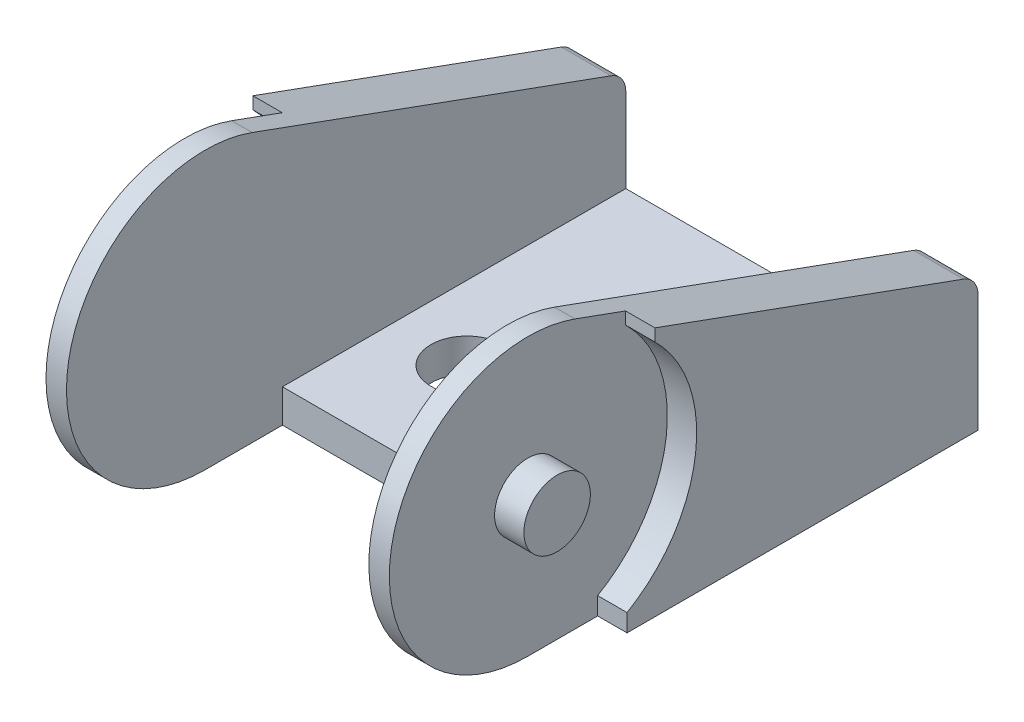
ISO-10303-21;
HEADER;
FILE_DESCRIPTION(('STEP AP214'),'2;1');
FILE_NAME('part.step','',(''),(''),'','','');
FILE_SCHEMA(('AUTOMOTIVE_DESIGN { 1 0 10303 214 1 1 1 1 }'));
ENDSEC;
DATA;
#1=APPLICATION_CONTEXT('core data for automotive mechanical design processes');
#2=APPLICATION_PROTOCOL_DEFINITION('international standard','automotive_design',2000,#1);
#3=PRODUCT_CONTEXT('',#1,'mechanical');
#4=PRODUCT('Part','Part','',(#3));
#5=PRODUCT_RELATED_PRODUCT_CATEGORY('part','',(#4));
#6=PRODUCT_DEFINITION_FORMATION('','',#4);
#7=PRODUCT_DEFINITION_CONTEXT('part definition',#1,'design');
#8=PRODUCT_DEFINITION('design','',#6,#7);
#9=PRODUCT_DEFINITION_SHAPE('','',#8);
#10=(LENGTH_UNIT() NAMED_UNIT(*) SI_UNIT(.MILLI.,.METRE.));
#11=(NAMED_UNIT(*) PLANE_ANGLE_UNIT() SI_UNIT($,.RADIAN.));
#12=(NAMED_UNIT(*) SI_UNIT($,.STERADIAN.) SOLID_ANGLE_UNIT());
#13=UNCERTAINTY_MEASURE_WITH_UNIT(LENGTH_MEASURE(1.E-05),#10,'distance_accuracy_value','');
#14=(GEOMETRIC_REPRESENTATION_CONTEXT(3) GLOBAL_UNCERTAINTY_ASSIGNED_CONTEXT((#13)) GLOBAL_UNIT_ASSIGNED_CONTEXT((#10,
#11,#12)) REPRESENTATION_CONTEXT('',''));
#15=CARTESIAN_POINT('',(0.,0.,0.));
#16=DIRECTION('',(0.,0.,1.));
#17=DIRECTION('',(1.,0.,0.));
#18=AXIS2_PLACEMENT_3D('',#15,#16,#17);
#19=CARTESIAN_POINT('',(-18.15,3.,-38.));
#20=DIRECTION('',(1.,0.,0.));
#21=DIRECTION('',(0.,0.,-1.));
#22=AXIS2_PLACEMENT_3D('',#19,#20,#21);
#23=PLANE('',#22);
#24=CARTESIAN_POINT('',(-18.15,12.5,0.));
#25=DIRECTION('',(1.,0.,0.));
#26=DIRECTION('',(0.,0.,-1.));
#27=AXIS2_PLACEMENT_3D('',#24,#25,#26);
#28=CIRCLE('',#27,3.);
#29=CARTESIAN_POINT('',(-18.15,12.5,-3.));
#30=VERTEX_POINT('',#29);
#31=EDGE_CURVE('E19',#30,#30,#28,.T.);
#32=ORIENTED_EDGE('',*,*,#31,.F.);
#33=EDGE_LOOP('',(#32));
#34=FACE_BOUND('',#33,.T.);
#35=ADVANCED_FACE('F16',(#34),#23,.F.);
#36=CARTESIAN_POINT('',(18.15,3.,-7.));
#37=DIRECTION('',(-1.,0.,0.));
#38=DIRECTION('',(0.,0.,1.));
#39=AXIS2_PLACEMENT_3D('',#36,#37,#38);
#40=PLANE('',#39);
#41=CARTESIAN_POINT('',(18.15,12.5,0.));
#42=DIRECTION('',(-1.,0.,0.));
#43=DIRECTION('',(0.,0.,1.));
#44=AXIS2_PLACEMENT_3D('',#41,#42,#43);
#45=CIRCLE('',#44,3.);
#46=CARTESIAN_POINT('',(18.15,12.5,3.));
#47=VERTEX_POINT('',#46);
#48=EDGE_CURVE('E322',#47,#47,#45,.T.);
#49=ORIENTED_EDGE('',*,*,#48,.F.);
#50=EDGE_LOOP('',(#49));
#51=FACE_BOUND('',#50,.T.);
#52=ADVANCED_FACE('F337',(#51),#40,.F.);
#53=CARTESIAN_POINT('',(15.5,21.4874044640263,-8.831));
#54=DIRECTION('',(0.,0.,-1.));
#55=DIRECTION('',(-1.,0.,0.));
#56=AXIS2_PLACEMENT_3D('',#53,#54,#55);
#57=PLANE('',#56);
#58=DIRECTION('',(1.,0.,0.));
#59=VECTOR('',#58,1.);
#60=CARTESIAN_POINT('',(13.65,22.591874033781,-8.831));
#61=LINE('',#60,#59);
#62=CARTESIAN_POINT('',(15.5,22.591874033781,-8.831));
#63=VERTEX_POINT('',#62);
#64=CARTESIAN_POINT('',(18.15,22.591874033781,-8.831));
#65=VERTEX_POINT('',#64);
#66=EDGE_CURVE('E324',#63,#65,#61,.T.);
#67=ORIENTED_EDGE('',*,*,#66,.F.);
#68=DIRECTION('',(0.,1.,0.));
#69=VECTOR('',#68,1.);
#70=CARTESIAN_POINT('',(15.5,21.4874044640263,-8.831));
#71=LINE('',#70,#69);
#72=CARTESIAN_POINT('',(15.5,21.4874044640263,-8.831));
#73=VERTEX_POINT('',#72);
#74=EDGE_CURVE('E241',#73,#63,#71,.T.);
#75=ORIENTED_EDGE('',*,*,#74,.F.);
#76=DIRECTION('',(-1.,0.,0.));
#77=VECTOR('',#76,1.);
#78=CARTESIAN_POINT('',(15.5,21.4874044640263,-8.831));
#79=LINE('',#78,#77);
#80=CARTESIAN_POINT('',(18.15,21.4874044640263,-8.831));
#81=VERTEX_POINT('',#80);
#82=EDGE_CURVE('E328',#73,#81,#79,.F.);
#83=ORIENTED_EDGE('',*,*,#82,.T.);
#84=DIRECTION('',(0.,1.,0.));
#85=VECTOR('',#84,1.);
#86=CARTESIAN_POINT('',(18.15,21.4874044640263,-8.831));
#87=LINE('',#86,#85);
#88=EDGE_CURVE('E235',#65,#81,#87,.F.);
#89=ORIENTED_EDGE('',*,*,#88,.F.);
#90=EDGE_LOOP('',(#67,#75,#83,#89));
#91=FACE_BOUND('',#90,.T.);
#92=ADVANCED_FACE('F343',(#91),#57,.F.);
#93=CARTESIAN_POINT('',(-15.5,21.4874044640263,-8.831));
#94=DIRECTION('',(0.,0.,1.));
#95=DIRECTION('',(1.,0.,0.));
#96=AXIS2_PLACEMENT_3D('',#93,#94,#95);
#97=PLANE('',#96);
#98=DIRECTION('',(0.,1.,0.));
#99=VECTOR('',#98,1.);
#100=CARTESIAN_POINT('',(-15.5,21.4874044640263,-8.831));
#101=LINE('',#100,#99);
#102=CARTESIAN_POINT('',(-15.5,21.4874044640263,-8.831));
#103=VERTEX_POINT('',#102);
#104=CARTESIAN_POINT('',(-15.5,22.591874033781,-8.831));
#105=VERTEX_POINT('',#104);
#106=EDGE_CURVE('E234',#103,#105,#101,.T.);
#107=ORIENTED_EDGE('',*,*,#106,.T.);
#108=DIRECTION('',(1.,0.,0.));
#109=VECTOR('',#108,1.);
#110=CARTESIAN_POINT('',(-13.65,22.591874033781,-8.831));
#111=LINE('',#110,#109);
#112=CARTESIAN_POINT('',(-18.15,22.591874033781,-8.831));
#113=VERTEX_POINT('',#112);
#114=EDGE_CURVE('E573',#105,#113,#111,.F.);
#115=ORIENTED_EDGE('',*,*,#114,.T.);
#116=DIRECTION('',(0.,1.,0.));
#117=VECTOR('',#116,1.);
#118=CARTESIAN_POINT('',(-18.15,21.4874044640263,-8.831));
#119=LINE('',#118,#117);
#120=CARTESIAN_POINT('',(-18.15,21.4874044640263,-8.831));
#121=VERTEX_POINT('',#120);
#122=EDGE_CURVE('E232',#113,#121,#119,.F.);
#123=ORIENTED_EDGE('',*,*,#122,.T.);
#124=DIRECTION('',(1.,0.,0.));
#125=VECTOR('',#124,1.);
#126=CARTESIAN_POINT('',(-15.5,21.4874044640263,-8.831));
#127=LINE('',#126,#125);
#128=EDGE_CURVE('E208',#121,#103,#127,.T.);
#129=ORIENTED_EDGE('',*,*,#128,.T.);
#130=EDGE_LOOP('',(#107,#115,#123,#129));
#131=FACE_BOUND('',#130,.T.);
#132=ADVANCED_FACE('F461',(#131),#97,.T.);
#133=CARTESIAN_POINT('',(-15.5,12.5,0.));
#134=DIRECTION('',(1.,0.,0.));
#135=DIRECTION('',(0.,0.,-1.));
#136=AXIS2_PLACEMENT_3D('',#133,#134,#135);
#137=CYLINDRICAL_SURFACE('',#136,3.);
#138=ORIENTED_EDGE('',*,*,#31,.T.);
#139=EDGE_LOOP('',(#138));
#140=FACE_BOUND('',#139,.T.);
#141=CARTESIAN_POINT('',(-15.5,12.5,0.));
#142=DIRECTION('',(1.,0.,0.));
#143=DIRECTION('',(0.,0.,-1.));
#144=AXIS2_PLACEMENT_3D('',#141,#142,#143);
#145=CIRCLE('',#144,3.);
#146=CARTESIAN_POINT('',(-15.5,12.5,-3.));
#147=VERTEX_POINT('',#146);
#148=EDGE_CURVE('E310',#147,#147,#145,.F.);
#149=ORIENTED_EDGE('',*,*,#148,.T.);
#150=EDGE_LOOP('',(#149));
#151=FACE_BOUND('',#150,.T.);
#152=ADVANCED_FACE('F333',(#140,#151),#137,.T.);
#153=CARTESIAN_POINT('',(15.5,12.5,0.));
#154=DIRECTION('',(-1.,0.,0.));
#155=DIRECTION('',(0.,0.,1.));
#156=AXIS2_PLACEMENT_3D('',#153,#154,#155);
#157=CYLINDRICAL_SURFACE('',#156,3.);
#158=ORIENTED_EDGE('',*,*,#48,.T.);
#159=EDGE_LOOP('',(#158));
#160=FACE_BOUND('',#159,.T.);
#161=CARTESIAN_POINT('',(15.5,12.5,0.));
#162=DIRECTION('',(-1.,0.,0.));
#163=DIRECTION('',(0.,0.,1.));
#164=AXIS2_PLACEMENT_3D('',#161,#162,#163);
#165=CIRCLE('',#164,3.);
#166=CARTESIAN_POINT('',(15.5,12.5,3.));
#167=VERTEX_POINT('',#166);
#168=EDGE_CURVE('E285',#167,#167,#165,.T.);
#169=ORIENTED_EDGE('',*,*,#168,.F.);
#170=EDGE_LOOP('',(#169));
#171=FACE_BOUND('',#170,.T.);
#172=ADVANCED_FACE('F455',(#160,#171),#157,.T.);
#173=CARTESIAN_POINT('',(13.65,12.4783645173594,-36.6826302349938));
#174=DIRECTION('',(0.,0.939948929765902,-0.34131511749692));
#175=DIRECTION('',(0.,0.34131511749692,0.939948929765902));
#176=AXIS2_PLACEMENT_3D('',#173,#174,#175);
#177=PLANE('',#176);
#178=DIRECTION('',(-1.,0.,0.));
#179=VECTOR('',#178,1.);
#180=CARTESIAN_POINT('',(13.65,24.2493616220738,-4.26643896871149));
#181=LINE('',#180,#179);
#182=CARTESIAN_POINT('',(15.5,24.2493616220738,-4.26643896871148));
#183=VERTEX_POINT('',#182);
#184=CARTESIAN_POINT('',(13.65,24.2493616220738,-4.26643896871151));
#185=VERTEX_POINT('',#184);
#186=EDGE_CURVE('E290',#183,#185,#181,.T.);
#187=ORIENTED_EDGE('',*,*,#186,.F.);
#188=DIRECTION('',(0.,0.341315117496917,0.939948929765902));
#189=VECTOR('',#188,1.);
#190=CARTESIAN_POINT('',(15.5,22.591874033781,-8.831));
#191=LINE('',#190,#189);
#192=EDGE_CURVE('E284',#63,#183,#191,.T.);
#193=ORIENTED_EDGE('',*,*,#192,.F.);
#194=ORIENTED_EDGE('',*,*,#66,.T.);
#195=DIRECTION('',(0.,-0.341315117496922,-0.939948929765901));
#196=VECTOR('',#195,1.);
#197=CARTESIAN_POINT('',(18.15,22.591874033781,-8.831));
#198=LINE('',#197,#196);
#199=CARTESIAN_POINT('',(18.15,12.4783645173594,-36.6826302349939));
#200=VERTEX_POINT('',#199);
#201=EDGE_CURVE('E277',#65,#200,#198,.T.);
#202=ORIENTED_EDGE('',*,*,#201,.T.);
#203=DIRECTION('',(-1.,0.,0.));
#204=VECTOR('',#203,1.);
#205=CARTESIAN_POINT('',(13.65,12.4783645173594,-36.6826302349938));
#206=LINE('',#205,#204);
#207=CARTESIAN_POINT('',(13.65,12.4783645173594,-36.6826302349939));
#208=VERTEX_POINT('',#207);
#209=EDGE_CURVE('E577',#208,#200,#206,.F.);
#210=ORIENTED_EDGE('',*,*,#209,.F.);
#211=DIRECTION('',(0.,0.341315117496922,0.939948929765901));
#212=VECTOR('',#211,1.);
#213=CARTESIAN_POINT('',(13.65,12.4783645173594,-36.6826302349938));
#214=LINE('',#213,#212);
#215=EDGE_CURVE('E294',#208,#185,#214,.T.);
#216=ORIENTED_EDGE('',*,*,#215,.T.);
#217=EDGE_LOOP('',(#187,#193,#194,#202,#210,#216));
#218=FACE_BOUND('',#217,.T.);
#219=ADVANCED_FACE('F451',(#218),#177,.T.);
#220=CARTESIAN_POINT('',(15.5,12.5,0.));
#221=DIRECTION('',(-1.,0.,0.));
#222=DIRECTION('',(0.,0.,1.));
#223=AXIS2_PLACEMENT_3D('',#220,#221,#222);
#224=CYLINDRICAL_SURFACE('',#223,12.6);
#225=ORIENTED_EDGE('',*,*,#82,.F.);
#226=CARTESIAN_POINT('',(15.5,12.5,0.));
#227=DIRECTION('',(-1.,0.,0.));
#228=DIRECTION('',(0.,0.,1.));
#229=AXIS2_PLACEMENT_3D('',#226,#227,#228);
#230=CIRCLE('',#229,12.6);
#231=CARTESIAN_POINT('',(15.5,1.5938595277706,-6.31));
#232=VERTEX_POINT('',#231);
#233=EDGE_CURVE('E278',#232,#73,#230,.F.);
#234=ORIENTED_EDGE('',*,*,#233,.F.);
#235=DIRECTION('',(1.,0.,0.));
#236=VECTOR('',#235,1.);
#237=CARTESIAN_POINT('',(15.5,1.5938595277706,-6.31));
#238=LINE('',#237,#236);
#239=CARTESIAN_POINT('',(18.15,1.5938595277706,-6.31));
#240=VERTEX_POINT('',#239);
#241=EDGE_CURVE('E503',#232,#240,#238,.T.);
#242=ORIENTED_EDGE('',*,*,#241,.T.);
#243=CARTESIAN_POINT('',(18.15,12.5,0.));
#244=DIRECTION('',(-1.,0.,0.));
#245=DIRECTION('',(0.,0.,1.));
#246=AXIS2_PLACEMENT_3D('',#243,#244,#245);
#247=CIRCLE('',#246,12.6);
#248=EDGE_CURVE('E270',#240,#81,#247,.F.);
#249=ORIENTED_EDGE('',*,*,#248,.T.);
#250=EDGE_LOOP('',(#225,#234,#242,#249));
#251=FACE_BOUND('',#250,.T.);
#252=ADVANCED_FACE('F447',(#251),#224,.F.);
#253=CARTESIAN_POINT('',(13.65,10.5984666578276,-36.));
#254=DIRECTION('',(-1.,0.,0.));
#255=DIRECTION('',(0.,0.,1.));
#256=AXIS2_PLACEMENT_3D('',#253,#254,#255);
#257=CYLINDRICAL_SURFACE('',#256,2.);
#258=CARTESIAN_POINT('',(13.65,10.5984666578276,-36.));
#259=DIRECTION('',(-1.,0.,0.));
#260=DIRECTION('',(0.,0.,1.));
#261=AXIS2_PLACEMENT_3D('',#258,#259,#260);
#262=CIRCLE('',#261,2.);
#263=CARTESIAN_POINT('',(13.65,10.5984666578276,-38.));
#264=VERTEX_POINT('',#263);
#265=EDGE_CURVE('E291',#264,#208,#262,.F.);
#266=ORIENTED_EDGE('',*,*,#265,.T.);
#267=ORIENTED_EDGE('',*,*,#209,.T.);
#268=CARTESIAN_POINT('',(18.15,10.5984666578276,-36.));
#269=DIRECTION('',(-1.,0.,0.));
#270=DIRECTION('',(0.,0.,1.));
#271=AXIS2_PLACEMENT_3D('',#268,#269,#270);
#272=CIRCLE('',#271,2.);
#273=CARTESIAN_POINT('',(18.15,10.5984666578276,-38.));
#274=VERTEX_POINT('',#273);
#275=EDGE_CURVE('E275',#200,#274,#272,.T.);
#276=ORIENTED_EDGE('',*,*,#275,.T.);
#277=DIRECTION('',(1.,0.,0.));
#278=VECTOR('',#277,1.);
#279=CARTESIAN_POINT('',(18.15,10.5984666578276,-38.));
#280=LINE('',#279,#278);
#281=EDGE_CURVE('E604',#274,#264,#280,.F.);
#282=ORIENTED_EDGE('',*,*,#281,.T.);
#283=EDGE_LOOP('',(#266,#267,#276,#282));
#284=FACE_BOUND('',#283,.T.);
#285=ADVANCED_FACE('F444',(#284),#257,.T.);
#286=CARTESIAN_POINT('',(0.,3.,0.));
#287=DIRECTION('',(0.,1.,0.));
#288=DIRECTION('',(0.,0.,1.));
#289=AXIS2_PLACEMENT_3D('',#286,#287,#288);
#290=PLANE('',#289);
#291=DIRECTION('',(-1.,0.,0.));
#292=VECTOR('',#291,1.);
#293=CARTESIAN_POINT('',(-7.,3.,-13.75));
#294=LINE('',#293,#292);
#295=CARTESIAN_POINT('',(-7.,3.,-13.75));
#296=VERTEX_POINT('',#295);
#297=CARTESIAN_POINT('',(-3.,3.,-13.75));
#298=VERTEX_POINT('',#297);
#299=EDGE_CURVE('E207',#296,#298,#294,.F.);
#300=ORIENTED_EDGE('',*,*,#299,.F.);
#301=CARTESIAN_POINT('',(-7.,3.,-17.));
#302=DIRECTION('',(0.,1.,0.));
#303=DIRECTION('',(0.,0.,1.));
#304=AXIS2_PLACEMENT_3D('',#301,#302,#303);
#305=CIRCLE('',#304,3.25);
#306=CARTESIAN_POINT('',(-7.,3.,-20.25));
#307=VERTEX_POINT('',#306);
#308=EDGE_CURVE('E216',#296,#307,#305,.F.);
#309=ORIENTED_EDGE('',*,*,#308,.T.);
#310=DIRECTION('',(1.,0.,0.));
#311=VECTOR('',#310,1.);
#312=CARTESIAN_POINT('',(-3.,3.,-20.25));
#313=LINE('',#312,#311);
#314=CARTESIAN_POINT('',(-3.,3.,-20.25));
#315=VERTEX_POINT('',#314);
#316=EDGE_CURVE('E212',#315,#307,#313,.F.);
#317=ORIENTED_EDGE('',*,*,#316,.F.);
#318=CARTESIAN_POINT('',(-3.,3.,-17.));
#319=DIRECTION('',(0.,1.,0.));
#320=DIRECTION('',(0.,0.,1.));
#321=AXIS2_PLACEMENT_3D('',#318,#319,#320);
#322=CIRCLE('',#321,3.25);
#323=EDGE_CURVE('E198',#315,#298,#322,.F.);
#324=ORIENTED_EDGE('',*,*,#323,.T.);
#325=EDGE_LOOP('',(#300,#309,#317,#324));
#326=FACE_BOUND('',#325,.T.);
#327=DIRECTION('',(-1.,0.,0.));
#328=VECTOR('',#327,1.);
#329=CARTESIAN_POINT('',(3.,3.,-27.75));
#330=LINE('',#329,#328);
#331=CARTESIAN_POINT('',(3.,3.,-27.75));
#332=VERTEX_POINT('',#331);
#333=CARTESIAN_POINT('',(7.,3.,-27.75));
#334=VERTEX_POINT('',#333);
#335=EDGE_CURVE('E228',#332,#334,#330,.F.);
#336=ORIENTED_EDGE('',*,*,#335,.F.);
#337=CARTESIAN_POINT('',(3.,3.,-31.));
#338=DIRECTION('',(0.,1.,0.));
#339=DIRECTION('',(0.,0.,1.));
#340=AXIS2_PLACEMENT_3D('',#337,#338,#339);
#341=CIRCLE('',#340,3.25);
#342=CARTESIAN_POINT('',(3.,3.,-34.25));
#343=VERTEX_POINT('',#342);
#344=EDGE_CURVE('E314',#332,#343,#341,.F.);
#345=ORIENTED_EDGE('',*,*,#344,.T.);
#346=DIRECTION('',(1.,0.,0.));
#347=VECTOR('',#346,1.);
#348=CARTESIAN_POINT('',(7.,3.,-34.25));
#349=LINE('',#348,#347);
#350=CARTESIAN_POINT('',(7.,3.,-34.25));
#351=VERTEX_POINT('',#350);
#352=EDGE_CURVE('E552',#351,#343,#349,.F.);
#353=ORIENTED_EDGE('',*,*,#352,.F.);
#354=CARTESIAN_POINT('',(7.,3.,-31.));
#355=DIRECTION('',(0.,1.,0.));
#356=DIRECTION('',(0.,0.,1.));
#357=AXIS2_PLACEMENT_3D('',#354,#355,#356);
#358=CIRCLE('',#357,3.25);
#359=EDGE_CURVE('E224',#351,#334,#358,.F.);
#360=ORIENTED_EDGE('',*,*,#359,.T.);
#361=EDGE_LOOP('',(#336,#345,#353,#360));
#362=FACE_BOUND('',#361,.T.);
#363=DIRECTION('',(0.,0.,-1.));
#364=VECTOR('',#363,1.);
#365=CARTESIAN_POINT('',(13.65,3.,0.));
#366=LINE('',#365,#364);
#367=CARTESIAN_POINT('',(13.65,3.,-7.));
#368=VERTEX_POINT('',#367);
#369=CARTESIAN_POINT('',(13.65,3.,-38.));
#370=VERTEX_POINT('',#369);
#371=EDGE_CURVE('E515',#368,#370,#366,.T.);
#372=ORIENTED_EDGE('',*,*,#371,.T.);
#373=DIRECTION('',(1.,0.,0.));
#374=VECTOR('',#373,1.);
#375=CARTESIAN_POINT('',(18.15,3.,-38.));
#376=LINE('',#375,#374);
#377=CARTESIAN_POINT('',(-13.65,3.,-38.));
#378=VERTEX_POINT('',#377);
#379=EDGE_CURVE('E591',#370,#378,#376,.F.);
#380=ORIENTED_EDGE('',*,*,#379,.T.);
#381=DIRECTION('',(0.,0.,-1.));
#382=VECTOR('',#381,1.);
#383=CARTESIAN_POINT('',(-13.65,3.,0.));
#384=LINE('',#383,#382);
#385=CARTESIAN_POINT('',(-13.65,3.,-7.));
#386=VERTEX_POINT('',#385);
#387=EDGE_CURVE('E302',#386,#378,#384,.T.);
#388=ORIENTED_EDGE('',*,*,#387,.F.);
#389=DIRECTION('',(-1.,0.,0.));
#390=VECTOR('',#389,1.);
#391=CARTESIAN_POINT('',(-18.15,3.,-7.));
#392=LINE('',#391,#390);
#393=EDGE_CURVE('E295',#386,#368,#392,.F.);
#394=ORIENTED_EDGE('',*,*,#393,.T.);
#395=EDGE_LOOP('',(#372,#380,#388,#394));
#396=FACE_BOUND('',#395,.T.);
#397=ADVANCED_FACE('F218',(#326,#362,#396),#290,.T.);
#398=CARTESIAN_POINT('',(-13.65,10.5984666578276,-36.));
#399=DIRECTION('',(1.,0.,0.));
#400=DIRECTION('',(0.,0.,-1.));
#401=AXIS2_PLACEMENT_3D('',#398,#399,#400);
#402=CYLINDRICAL_SURFACE('',#401,2.);
#403=CARTESIAN_POINT('',(-13.65,10.5984666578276,-36.));
#404=DIRECTION('',(1.,0.,0.));
#405=DIRECTION('',(0.,0.,-1.));
#406=AXIS2_PLACEMENT_3D('',#403,#404,#405);
#407=CIRCLE('',#406,2.);
#408=CARTESIAN_POINT('',(-13.65,10.5984666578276,-38.));
#409=VERTEX_POINT('',#408);
#410=CARTESIAN_POINT('',(-13.65,12.4783645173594,-36.6826302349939));
#411=VERTEX_POINT('',#410);
#412=EDGE_CURVE('E300',#409,#411,#407,.T.);
#413=ORIENTED_EDGE('',*,*,#412,.F.);
#414=DIRECTION('',(1.,0.,0.));
#415=VECTOR('',#414,1.);
#416=CARTESIAN_POINT('',(18.15,10.5984666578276,-38.));
#417=LINE('',#416,#415);
#418=CARTESIAN_POINT('',(-18.15,10.5984666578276,-38.));
#419=VERTEX_POINT('',#418);
#420=EDGE_CURVE('E582',#409,#419,#417,.F.);
#421=ORIENTED_EDGE('',*,*,#420,.T.);
#422=CARTESIAN_POINT('',(-18.15,10.5984666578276,-36.));
#423=DIRECTION('',(1.,0.,0.));
#424=DIRECTION('',(0.,0.,-1.));
#425=AXIS2_PLACEMENT_3D('',#422,#423,#424);
#426=CIRCLE('',#425,2.);
#427=CARTESIAN_POINT('',(-18.15,12.4783645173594,-36.6826302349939));
#428=VERTEX_POINT('',#427);
#429=EDGE_CURVE('E266',#419,#428,#426,.T.);
#430=ORIENTED_EDGE('',*,*,#429,.T.);
#431=DIRECTION('',(1.,0.,0.));
#432=VECTOR('',#431,1.);
#433=CARTESIAN_POINT('',(-13.65,12.4783645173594,-36.6826302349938));
#434=LINE('',#433,#432);
#435=EDGE_CURVE('E574',#428,#411,#434,.T.);
#436=ORIENTED_EDGE('',*,*,#435,.T.);
#437=EDGE_LOOP('',(#413,#421,#430,#436));
#438=FACE_BOUND('',#437,.T.);
#439=ADVANCED_FACE('F437',(#438),#402,.T.);
#440=CARTESIAN_POINT('',(-13.65,12.4783645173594,-36.6826302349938));
#441=DIRECTION('',(0.,-0.939948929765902,0.34131511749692));
#442=DIRECTION('',(0.,-0.34131511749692,-0.939948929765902));
#443=AXIS2_PLACEMENT_3D('',#440,#441,#442);
#444=PLANE('',#443);
#445=DIRECTION('',(0.,0.341315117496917,0.939948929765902));
#446=VECTOR('',#445,1.);
#447=CARTESIAN_POINT('',(-15.5,22.591874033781,-8.831));
#448=LINE('',#447,#446);
#449=CARTESIAN_POINT('',(-15.5,24.2493616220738,-4.26643896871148));
#450=VERTEX_POINT('',#449);
#451=EDGE_CURVE('E309',#105,#450,#448,.T.);
#452=ORIENTED_EDGE('',*,*,#451,.T.);
#453=DIRECTION('',(1.,0.,0.));
#454=VECTOR('',#453,1.);
#455=CARTESIAN_POINT('',(-13.65,24.2493616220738,-4.26643896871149));
#456=LINE('',#455,#454);
#457=CARTESIAN_POINT('',(-13.65,24.2493616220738,-4.26643896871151));
#458=VERTEX_POINT('',#457);
#459=EDGE_CURVE('E305',#458,#450,#456,.F.);
#460=ORIENTED_EDGE('',*,*,#459,.F.);
#461=DIRECTION('',(0.,0.341315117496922,0.939948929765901));
#462=VECTOR('',#461,1.);
#463=CARTESIAN_POINT('',(-13.65,12.4783645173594,-36.6826302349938));
#464=LINE('',#463,#462);
#465=EDGE_CURVE('E299',#411,#458,#464,.T.);
#466=ORIENTED_EDGE('',*,*,#465,.F.);
#467=ORIENTED_EDGE('',*,*,#435,.F.);
#468=DIRECTION('',(0.,0.341315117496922,0.939948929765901));
#469=VECTOR('',#468,1.);
#470=CARTESIAN_POINT('',(-18.15,12.4783645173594,-36.6826302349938));
#471=LINE('',#470,#469);
#472=EDGE_CURVE('E265',#428,#113,#471,.T.);
#473=ORIENTED_EDGE('',*,*,#472,.T.);
#474=ORIENTED_EDGE('',*,*,#114,.F.);
#475=EDGE_LOOP('',(#452,#460,#466,#467,#473,#474));
#476=FACE_BOUND('',#475,.T.);
#477=ADVANCED_FACE('F433',(#476),#444,.F.);
#478=CARTESIAN_POINT('',(-15.5,12.5,0.));
#479=DIRECTION('',(1.,0.,0.));
#480=DIRECTION('',(0.,0.,-1.));
#481=AXIS2_PLACEMENT_3D('',#478,#479,#480);
#482=CYLINDRICAL_SURFACE('',#481,12.6);
#483=DIRECTION('',(1.,0.,0.));
#484=VECTOR('',#483,1.);
#485=CARTESIAN_POINT('',(-15.5,1.5938595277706,-6.31));
#486=LINE('',#485,#484);
#487=CARTESIAN_POINT('',(-15.5,1.5938595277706,-6.31));
#488=VERTEX_POINT('',#487);
#489=CARTESIAN_POINT('',(-18.15,1.5938595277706,-6.31));
#490=VERTEX_POINT('',#489);
#491=EDGE_CURVE('E262',#488,#490,#486,.F.);
#492=ORIENTED_EDGE('',*,*,#491,.F.);
#493=CARTESIAN_POINT('',(-15.5,12.5,0.));
#494=DIRECTION('',(1.,0.,0.));
#495=DIRECTION('',(0.,0.,-1.));
#496=AXIS2_PLACEMENT_3D('',#493,#494,#495);
#497=CIRCLE('',#496,12.6);
#498=EDGE_CURVE('E306',#488,#103,#497,.T.);
#499=ORIENTED_EDGE('',*,*,#498,.T.);
#500=ORIENTED_EDGE('',*,*,#128,.F.);
#501=CARTESIAN_POINT('',(-18.15,12.5,0.));
#502=DIRECTION('',(1.,0.,0.));
#503=DIRECTION('',(0.,0.,-1.));
#504=AXIS2_PLACEMENT_3D('',#501,#502,#503);
#505=CIRCLE('',#504,12.6);
#506=EDGE_CURVE('E263',#121,#490,#505,.F.);
#507=ORIENTED_EDGE('',*,*,#506,.T.);
#508=EDGE_LOOP('',(#492,#499,#500,#507));
#509=FACE_BOUND('',#508,.T.);
#510=ADVANCED_FACE('F430',(#509),#482,.F.);
#511=CARTESIAN_POINT('',(-3.,3.,-17.));
#512=DIRECTION('',(0.,1.,0.));
#513=DIRECTION('',(0.,0.,1.));
#514=AXIS2_PLACEMENT_3D('',#511,#512,#513);
#515=CYLINDRICAL_SURFACE('',#514,3.25);
#516=DIRECTION('',(0.,1.,0.));
#517=VECTOR('',#516,1.);
#518=CARTESIAN_POINT('',(-3.,3.,-13.75));
#519=LINE('',#518,#517);
#520=CARTESIAN_POINT('',(-3.,0.,-13.75));
#521=VERTEX_POINT('',#520);
#522=EDGE_CURVE('E204',#298,#521,#519,.F.);
#523=ORIENTED_EDGE('',*,*,#522,.F.);
#524=ORIENTED_EDGE('',*,*,#323,.F.);
#525=DIRECTION('',(0.,1.,0.));
#526=VECTOR('',#525,1.);
#527=CARTESIAN_POINT('',(-3.,3.,-20.25));
#528=LINE('',#527,#526);
#529=CARTESIAN_POINT('',(-3.,0.,-20.25));
#530=VERTEX_POINT('',#529);
#531=EDGE_CURVE('E202',#530,#315,#528,.T.);
#532=ORIENTED_EDGE('',*,*,#531,.F.);
#533=CARTESIAN_POINT('',(-3.,0.,-17.));
#534=DIRECTION('',(0.,1.,0.));
#535=DIRECTION('',(0.,0.,1.));
#536=AXIS2_PLACEMENT_3D('',#533,#534,#535);
#537=CIRCLE('',#536,3.25);
#538=EDGE_CURVE('E260',#530,#521,#537,.F.);
#539=ORIENTED_EDGE('',*,*,#538,.T.);
#540=EDGE_LOOP('',(#523,#524,#532,#539));
#541=FACE_BOUND('',#540,.T.);
#542=ADVANCED_FACE('F200',(#541),#515,.F.);
#543=CARTESIAN_POINT('',(-7.,3.,-13.75));
#544=DIRECTION('',(0.,0.,-1.));
#545=DIRECTION('',(-1.,0.,0.));
#546=AXIS2_PLACEMENT_3D('',#543,#544,#545);
#547=PLANE('',#546);
#548=ORIENTED_EDGE('',*,*,#299,.T.);
#549=ORIENTED_EDGE('',*,*,#522,.T.);
#550=DIRECTION('',(1.,0.,0.));
#551=VECTOR('',#550,1.);
#552=CARTESIAN_POINT('',(0.,0.,-13.75));
#553=LINE('',#552,#551);
#554=CARTESIAN_POINT('',(-7.,0.,-13.75));
#555=VERTEX_POINT('',#554);
#556=EDGE_CURVE('E259',#521,#555,#553,.F.);
#557=ORIENTED_EDGE('',*,*,#556,.T.);
#558=DIRECTION('',(0.,1.,0.));
#559=VECTOR('',#558,1.);
#560=CARTESIAN_POINT('',(-7.,3.,-13.75));
#561=LINE('',#560,#559);
#562=EDGE_CURVE('E321',#555,#296,#561,.T.);
#563=ORIENTED_EDGE('',*,*,#562,.T.);
#564=EDGE_LOOP('',(#548,#549,#557,#563));
#565=FACE_BOUND('',#564,.T.);
#566=ADVANCED_FACE('F423',(#565),#547,.T.);
#567=CARTESIAN_POINT('',(-7.,3.,-17.));
#568=DIRECTION('',(0.,1.,0.));
#569=DIRECTION('',(0.,0.,1.));
#570=AXIS2_PLACEMENT_3D('',#567,#568,#569);
#571=CYLINDRICAL_SURFACE('',#570,3.25);
#572=DIRECTION('',(0.,1.,0.));
#573=VECTOR('',#572,1.);
#574=CARTESIAN_POINT('',(-7.,3.,-20.25));
#575=LINE('',#574,#573);
#576=CARTESIAN_POINT('',(-7.,0.,-20.25));
#577=VERTEX_POINT('',#576);
#578=EDGE_CURVE('E222',#307,#577,#575,.F.);
#579=ORIENTED_EDGE('',*,*,#578,.F.);
#580=ORIENTED_EDGE('',*,*,#308,.F.);
#581=ORIENTED_EDGE('',*,*,#562,.F.);
#582=CARTESIAN_POINT('',(-7.,0.,-17.));
#583=DIRECTION('',(0.,1.,0.));
#584=DIRECTION('',(0.,0.,1.));
#585=AXIS2_PLACEMENT_3D('',#582,#583,#584);
#586=CIRCLE('',#585,3.25);
#587=EDGE_CURVE('E256',#555,#577,#586,.F.);
#588=ORIENTED_EDGE('',*,*,#587,.T.);
#589=EDGE_LOOP('',(#579,#580,#581,#588));
#590=FACE_BOUND('',#589,.T.);
#591=ADVANCED_FACE('F420',(#590),#571,.F.);
#592=CARTESIAN_POINT('',(-3.,3.,-20.25));
#593=DIRECTION('',(0.,0.,1.));
#594=DIRECTION('',(1.,0.,0.));
#595=AXIS2_PLACEMENT_3D('',#592,#593,#594);
#596=PLANE('',#595);
#597=ORIENTED_EDGE('',*,*,#316,.T.);
#598=ORIENTED_EDGE('',*,*,#578,.T.);
#599=DIRECTION('',(1.,0.,0.));
#600=VECTOR('',#599,1.);
#601=CARTESIAN_POINT('',(0.,0.,-20.25));
#602=LINE('',#601,#600);
#603=EDGE_CURVE('E215',#577,#530,#602,.T.);
#604=ORIENTED_EDGE('',*,*,#603,.T.);
#605=ORIENTED_EDGE('',*,*,#531,.T.);
#606=EDGE_LOOP('',(#597,#598,#604,#605));
#607=FACE_BOUND('',#606,.T.);
#608=ADVANCED_FACE('F211',(#607),#596,.T.);
#609=CARTESIAN_POINT('',(7.,3.,-31.));
#610=DIRECTION('',(0.,1.,0.));
#611=DIRECTION('',(0.,0.,1.));
#612=AXIS2_PLACEMENT_3D('',#609,#610,#611);
#613=CYLINDRICAL_SURFACE('',#612,3.25);
#614=DIRECTION('',(0.,1.,0.));
#615=VECTOR('',#614,1.);
#616=CARTESIAN_POINT('',(7.,3.,-27.75));
#617=LINE('',#616,#615);
#618=CARTESIAN_POINT('',(7.,0.,-27.75));
#619=VERTEX_POINT('',#618);
#620=EDGE_CURVE('E557',#334,#619,#617,.F.);
#621=ORIENTED_EDGE('',*,*,#620,.F.);
#622=ORIENTED_EDGE('',*,*,#359,.F.);
#623=DIRECTION('',(0.,1.,0.));
#624=VECTOR('',#623,1.);
#625=CARTESIAN_POINT('',(7.,3.,-34.25));
#626=LINE('',#625,#624);
#627=CARTESIAN_POINT('',(7.,0.,-34.25));
#628=VERTEX_POINT('',#627);
#629=EDGE_CURVE('E317',#628,#351,#626,.T.);
#630=ORIENTED_EDGE('',*,*,#629,.F.);
#631=CARTESIAN_POINT('',(7.,0.,-31.));
#632=DIRECTION('',(0.,1.,0.));
#633=DIRECTION('',(0.,0.,1.));
#634=AXIS2_PLACEMENT_3D('',#631,#632,#633);
#635=CIRCLE('',#634,3.25);
#636=EDGE_CURVE('E253',#628,#619,#635,.F.);
#637=ORIENTED_EDGE('',*,*,#636,.T.);
#638=EDGE_LOOP('',(#621,#622,#630,#637));
#639=FACE_BOUND('',#638,.T.);
#640=ADVANCED_FACE('F413',(#639),#613,.F.);
#641=CARTESIAN_POINT('',(3.,3.,-27.75));
#642=DIRECTION('',(0.,0.,-1.));
#643=DIRECTION('',(-1.,0.,0.));
#644=AXIS2_PLACEMENT_3D('',#641,#642,#643);
#645=PLANE('',#644);
#646=ORIENTED_EDGE('',*,*,#335,.T.);
#647=ORIENTED_EDGE('',*,*,#620,.T.);
#648=DIRECTION('',(1.,0.,0.));
#649=VECTOR('',#648,1.);
#650=CARTESIAN_POINT('',(0.,0.,-27.75));
#651=LINE('',#650,#649);
#652=CARTESIAN_POINT('',(3.,0.,-27.75));
#653=VERTEX_POINT('',#652);
#654=EDGE_CURVE('E252',#619,#653,#651,.F.);
#655=ORIENTED_EDGE('',*,*,#654,.T.);
#656=DIRECTION('',(0.,1.,0.));
#657=VECTOR('',#656,1.);
#658=CARTESIAN_POINT('',(3.,3.,-27.75));
#659=LINE('',#658,#657);
#660=EDGE_CURVE('E318',#653,#332,#659,.T.);
#661=ORIENTED_EDGE('',*,*,#660,.T.);
#662=EDGE_LOOP('',(#646,#647,#655,#661));
#663=FACE_BOUND('',#662,.T.);
#664=ADVANCED_FACE('F409',(#663),#645,.T.);
#665=CARTESIAN_POINT('',(3.,3.,-31.));
#666=DIRECTION('',(0.,1.,0.));
#667=DIRECTION('',(0.,0.,1.));
#668=AXIS2_PLACEMENT_3D('',#665,#666,#667);
#669=CYLINDRICAL_SURFACE('',#668,3.25);
#670=DIRECTION('',(0.,1.,0.));
#671=VECTOR('',#670,1.);
#672=CARTESIAN_POINT('',(3.,3.,-34.25));
#673=LINE('',#672,#671);
#674=CARTESIAN_POINT('',(3.,0.,-34.25));
#675=VERTEX_POINT('',#674);
#676=EDGE_CURVE('E313',#343,#675,#673,.F.);
#677=ORIENTED_EDGE('',*,*,#676,.F.);
#678=ORIENTED_EDGE('',*,*,#344,.F.);
#679=ORIENTED_EDGE('',*,*,#660,.F.);
#680=CARTESIAN_POINT('',(3.,0.,-31.));
#681=DIRECTION('',(0.,1.,0.));
#682=DIRECTION('',(0.,0.,1.));
#683=AXIS2_PLACEMENT_3D('',#680,#681,#682);
#684=CIRCLE('',#683,3.25);
#685=EDGE_CURVE('E248',#653,#675,#684,.F.);
#686=ORIENTED_EDGE('',*,*,#685,.T.);
#687=EDGE_LOOP('',(#677,#678,#679,#686));
#688=FACE_BOUND('',#687,.T.);
#689=ADVANCED_FACE('F405',(#688),#669,.F.);
#690=CARTESIAN_POINT('',(7.,3.,-34.25));
#691=DIRECTION('',(0.,0.,1.));
#692=DIRECTION('',(1.,0.,0.));
#693=AXIS2_PLACEMENT_3D('',#690,#691,#692);
#694=PLANE('',#693);
#695=ORIENTED_EDGE('',*,*,#352,.T.);
#696=ORIENTED_EDGE('',*,*,#676,.T.);
#697=DIRECTION('',(1.,0.,0.));
#698=VECTOR('',#697,1.);
#699=CARTESIAN_POINT('',(0.,0.,-34.25));
#700=LINE('',#699,#698);
#701=EDGE_CURVE('E251',#675,#628,#700,.T.);
#702=ORIENTED_EDGE('',*,*,#701,.T.);
#703=ORIENTED_EDGE('',*,*,#629,.T.);
#704=EDGE_LOOP('',(#695,#696,#702,#703));
#705=FACE_BOUND('',#704,.T.);
#706=ADVANCED_FACE('F401',(#705),#694,.T.);
#707=CARTESIAN_POINT('',(-15.5,12.5,0.));
#708=DIRECTION('',(1.,0.,0.));
#709=DIRECTION('',(0.,0.,-1.));
#710=AXIS2_PLACEMENT_3D('',#707,#708,#709);
#711=PLANE('',#710);
#712=ORIENTED_EDGE('',*,*,#106,.F.);
#713=ORIENTED_EDGE('',*,*,#498,.F.);
#714=DIRECTION('',(0.,-1.,0.));
#715=VECTOR('',#714,1.);
#716=CARTESIAN_POINT('',(-15.5,0.,-6.31));
#717=LINE('',#716,#715);
#718=CARTESIAN_POINT('',(-15.5,0.,-6.31));
#719=VERTEX_POINT('',#718);
#720=EDGE_CURVE('E544',#719,#488,#717,.F.);
#721=ORIENTED_EDGE('',*,*,#720,.F.);
#722=DIRECTION('',(0.,0.,1.));
#723=VECTOR('',#722,1.);
#724=CARTESIAN_POINT('',(-15.5,0.,0.));
#725=LINE('',#724,#723);
#726=CARTESIAN_POINT('',(-15.5,0.,0.));
#727=VERTEX_POINT('',#726);
#728=EDGE_CURVE('E535',#719,#727,#725,.T.);
#729=ORIENTED_EDGE('',*,*,#728,.T.);
#730=CARTESIAN_POINT('',(-15.5,12.5,0.));
#731=DIRECTION('',(1.,0.,0.));
#732=DIRECTION('',(0.,0.,-1.));
#733=AXIS2_PLACEMENT_3D('',#730,#731,#732);
#734=CIRCLE('',#733,12.5);
#735=EDGE_CURVE('E303',#450,#727,#734,.T.);
#736=ORIENTED_EDGE('',*,*,#735,.F.);
#737=ORIENTED_EDGE('',*,*,#451,.F.);
#738=EDGE_LOOP('',(#712,#713,#721,#729,#736,#737));
#739=FACE_BOUND('',#738,.T.);
#740=ORIENTED_EDGE('',*,*,#148,.F.);
#741=EDGE_LOOP('',(#740));
#742=FACE_BOUND('',#741,.T.);
#743=ADVANCED_FACE('F397',(#739,#742),#711,.F.);
#744=CARTESIAN_POINT('',(-13.65,12.5,0.));
#745=DIRECTION('',(1.,0.,0.));
#746=DIRECTION('',(0.,0.,-1.));
#747=AXIS2_PLACEMENT_3D('',#744,#745,#746);
#748=CYLINDRICAL_SURFACE('',#747,12.5);
#749=DIRECTION('',(1.,0.,0.));
#750=VECTOR('',#749,1.);
#751=CARTESIAN_POINT('',(0.,0.,0.));
#752=LINE('',#751,#750);
#753=CARTESIAN_POINT('',(-13.65,0.,0.));
#754=VERTEX_POINT('',#753);
#755=EDGE_CURVE('E529',#727,#754,#752,.T.);
#756=ORIENTED_EDGE('',*,*,#755,.T.);
#757=CARTESIAN_POINT('',(-13.65,12.5,0.));
#758=DIRECTION('',(1.,0.,0.));
#759=DIRECTION('',(0.,0.,-1.));
#760=AXIS2_PLACEMENT_3D('',#757,#758,#759);
#761=CIRCLE('',#760,12.5);
#762=EDGE_CURVE('E296',#458,#754,#761,.T.);
#763=ORIENTED_EDGE('',*,*,#762,.F.);
#764=ORIENTED_EDGE('',*,*,#459,.T.);
#765=ORIENTED_EDGE('',*,*,#735,.T.);
#766=EDGE_LOOP('',(#756,#763,#764,#765));
#767=FACE_BOUND('',#766,.T.);
#768=ADVANCED_FACE('F393',(#767),#748,.T.);
#769=CARTESIAN_POINT('',(-13.65,12.5,0.));
#770=DIRECTION('',(1.,0.,0.));
#771=DIRECTION('',(0.,0.,-1.));
#772=AXIS2_PLACEMENT_3D('',#769,#770,#771);
#773=PLANE('',#772);
#774=ORIENTED_EDGE('',*,*,#762,.T.);
#775=DIRECTION('',(0.,0.,1.));
#776=VECTOR('',#775,1.);
#777=CARTESIAN_POINT('',(-13.65,0.,0.));
#778=LINE('',#777,#776);
#779=CARTESIAN_POINT('',(-13.65,0.,-7.));
#780=VERTEX_POINT('',#779);
#781=EDGE_CURVE('E520',#754,#780,#778,.F.);
#782=ORIENTED_EDGE('',*,*,#781,.T.);
#783=DIRECTION('',(0.,1.,0.));
#784=VECTOR('',#783,1.);
#785=CARTESIAN_POINT('',(-13.65,3.,-7.));
#786=LINE('',#785,#784);
#787=EDGE_CURVE('E298',#780,#386,#786,.T.);
#788=ORIENTED_EDGE('',*,*,#787,.T.);
#789=ORIENTED_EDGE('',*,*,#387,.T.);
#790=DIRECTION('',(0.,1.,0.));
#791=VECTOR('',#790,1.);
#792=CARTESIAN_POINT('',(-13.65,3.,-38.));
#793=LINE('',#792,#791);
#794=EDGE_CURVE('E584',#378,#409,#793,.T.);
#795=ORIENTED_EDGE('',*,*,#794,.T.);
#796=ORIENTED_EDGE('',*,*,#412,.T.);
#797=ORIENTED_EDGE('',*,*,#465,.T.);
#798=EDGE_LOOP('',(#774,#782,#788,#789,#795,#796,#797));
#799=FACE_BOUND('',#798,.T.);
#800=ADVANCED_FACE('F389',(#799),#773,.T.);
#801=CARTESIAN_POINT('',(-18.15,3.,-7.));
#802=DIRECTION('',(0.,0.,-1.));
#803=DIRECTION('',(-1.,0.,0.));
#804=AXIS2_PLACEMENT_3D('',#801,#802,#803);
#805=PLANE('',#804);
#806=ORIENTED_EDGE('',*,*,#787,.F.);
#807=DIRECTION('',(1.,0.,0.));
#808=VECTOR('',#807,1.);
#809=CARTESIAN_POINT('',(0.,0.,-7.));
#810=LINE('',#809,#808);
#811=CARTESIAN_POINT('',(13.65,0.,-7.));
#812=VERTEX_POINT('',#811);
#813=EDGE_CURVE('E508',#780,#812,#810,.T.);
#814=ORIENTED_EDGE('',*,*,#813,.T.);
#815=DIRECTION('',(0.,1.,0.));
#816=VECTOR('',#815,1.);
#817=CARTESIAN_POINT('',(13.65,12.5,-7.));
#818=LINE('',#817,#816);
#819=EDGE_CURVE('E512',#812,#368,#818,.T.);
#820=ORIENTED_EDGE('',*,*,#819,.T.);
#821=ORIENTED_EDGE('',*,*,#393,.F.);
#822=EDGE_LOOP('',(#806,#814,#820,#821));
#823=FACE_BOUND('',#822,.T.);
#824=ADVANCED_FACE('F385',(#823),#805,.F.);
#825=CARTESIAN_POINT('',(13.65,12.5,0.));
#826=DIRECTION('',(1.,0.,0.));
#827=DIRECTION('',(0.,0.,-1.));
#828=AXIS2_PLACEMENT_3D('',#825,#826,#827);
#829=PLANE('',#828);
#830=ORIENTED_EDGE('',*,*,#819,.F.);
#831=DIRECTION('',(0.,0.,1.));
#832=VECTOR('',#831,1.);
#833=CARTESIAN_POINT('',(13.65,0.,0.));
#834=LINE('',#833,#832);
#835=CARTESIAN_POINT('',(13.65,0.,0.));
#836=VERTEX_POINT('',#835);
#837=EDGE_CURVE('E490',#812,#836,#834,.T.);
#838=ORIENTED_EDGE('',*,*,#837,.T.);
#839=CARTESIAN_POINT('',(13.65,12.5,0.));
#840=DIRECTION('',(-1.,0.,0.));
#841=DIRECTION('',(0.,0.,1.));
#842=AXIS2_PLACEMENT_3D('',#839,#840,#841);
#843=CIRCLE('',#842,12.5);
#844=EDGE_CURVE('E288',#185,#836,#843,.F.);
#845=ORIENTED_EDGE('',*,*,#844,.F.);
#846=ORIENTED_EDGE('',*,*,#215,.F.);
#847=ORIENTED_EDGE('',*,*,#265,.F.);
#848=DIRECTION('',(0.,1.,0.));
#849=VECTOR('',#848,1.);
#850=CARTESIAN_POINT('',(13.65,3.,-38.));
#851=LINE('',#850,#849);
#852=EDGE_CURVE('E599',#264,#370,#851,.F.);
#853=ORIENTED_EDGE('',*,*,#852,.T.);
#854=ORIENTED_EDGE('',*,*,#371,.F.);
#855=EDGE_LOOP('',(#830,#838,#845,#846,#847,#853,#854));
#856=FACE_BOUND('',#855,.T.);
#857=ADVANCED_FACE('F381',(#856),#829,.F.);
#858=CARTESIAN_POINT('',(13.65,12.5,0.));
#859=DIRECTION('',(-1.,0.,0.));
#860=DIRECTION('',(0.,0.,1.));
#861=AXIS2_PLACEMENT_3D('',#858,#859,#860);
#862=CYLINDRICAL_SURFACE('',#861,12.5);
#863=ORIENTED_EDGE('',*,*,#186,.T.);
#864=ORIENTED_EDGE('',*,*,#844,.T.);
#865=DIRECTION('',(1.,0.,0.));
#866=VECTOR('',#865,1.);
#867=CARTESIAN_POINT('',(0.,0.,0.));
#868=LINE('',#867,#866);
#869=CARTESIAN_POINT('',(15.5,0.,0.));
#870=VERTEX_POINT('',#869);
#871=EDGE_CURVE('E486',#836,#870,#868,.T.);
#872=ORIENTED_EDGE('',*,*,#871,.T.);
#873=CARTESIAN_POINT('',(15.5,12.5,0.));
#874=DIRECTION('',(-1.,0.,0.));
#875=DIRECTION('',(0.,0.,1.));
#876=AXIS2_PLACEMENT_3D('',#873,#874,#875);
#877=CIRCLE('',#876,12.5);
#878=EDGE_CURVE('E282',#183,#870,#877,.F.);
#879=ORIENTED_EDGE('',*,*,#878,.F.);
#880=EDGE_LOOP('',(#863,#864,#872,#879));
#881=FACE_BOUND('',#880,.T.);
#882=ADVANCED_FACE('F377',(#881),#862,.T.);
#883=CARTESIAN_POINT('',(15.5,12.5,0.));
#884=DIRECTION('',(1.,0.,0.));
#885=DIRECTION('',(0.,0.,-1.));
#886=AXIS2_PLACEMENT_3D('',#883,#884,#885);
#887=PLANE('',#886);
#888=ORIENTED_EDGE('',*,*,#233,.T.);
#889=ORIENTED_EDGE('',*,*,#74,.T.);
#890=ORIENTED_EDGE('',*,*,#192,.T.);
#891=ORIENTED_EDGE('',*,*,#878,.T.);
#892=DIRECTION('',(0.,0.,1.));
#893=VECTOR('',#892,1.);
#894=CARTESIAN_POINT('',(15.5,0.,0.));
#895=LINE('',#894,#893);
#896=CARTESIAN_POINT('',(15.5,0.,-6.31));
#897=VERTEX_POINT('',#896);
#898=EDGE_CURVE('E489',#870,#897,#895,.F.);
#899=ORIENTED_EDGE('',*,*,#898,.T.);
#900=DIRECTION('',(0.,1.,0.));
#901=VECTOR('',#900,1.);
#902=CARTESIAN_POINT('',(15.5,0.,-6.31));
#903=LINE('',#902,#901);
#904=EDGE_CURVE('E281',#897,#232,#903,.T.);
#905=ORIENTED_EDGE('',*,*,#904,.T.);
#906=EDGE_LOOP('',(#888,#889,#890,#891,#899,#905));
#907=FACE_BOUND('',#906,.T.);
#908=ORIENTED_EDGE('',*,*,#168,.T.);
#909=EDGE_LOOP('',(#908));
#910=FACE_BOUND('',#909,.T.);
#911=ADVANCED_FACE('F373',(#907,#910),#887,.T.);
#912=CARTESIAN_POINT('',(15.5,0.,-6.31));
#913=DIRECTION('',(0.,0.,-1.));
#914=DIRECTION('',(0.,1.,0.));
#915=AXIS2_PLACEMENT_3D('',#912,#913,#914);
#916=PLANE('',#915);
#917=ORIENTED_EDGE('',*,*,#241,.F.);
#918=ORIENTED_EDGE('',*,*,#904,.F.);
#919=DIRECTION('',(1.,0.,0.));
#920=VECTOR('',#919,1.);
#921=CARTESIAN_POINT('',(0.,0.,-6.31));
#922=LINE('',#921,#920);
#923=CARTESIAN_POINT('',(18.15,0.,-6.31));
#924=VERTEX_POINT('',#923);
#925=EDGE_CURVE('E493',#897,#924,#922,.T.);
#926=ORIENTED_EDGE('',*,*,#925,.T.);
#927=DIRECTION('',(0.,1.,0.));
#928=VECTOR('',#927,1.);
#929=CARTESIAN_POINT('',(18.15,3.,-6.31));
#930=LINE('',#929,#928);
#931=EDGE_CURVE('E274',#924,#240,#930,.T.);
#932=ORIENTED_EDGE('',*,*,#931,.T.);
#933=EDGE_LOOP('',(#917,#918,#926,#932));
#934=FACE_BOUND('',#933,.T.);
#935=ADVANCED_FACE('F369',(#934),#916,.F.);
#936=CARTESIAN_POINT('',(18.15,3.,-7.));
#937=DIRECTION('',(-1.,0.,0.));
#938=DIRECTION('',(0.,0.,1.));
#939=AXIS2_PLACEMENT_3D('',#936,#937,#938);
#940=PLANE('',#939);
#941=ORIENTED_EDGE('',*,*,#931,.F.);
#942=DIRECTION('',(0.,0.,1.));
#943=VECTOR('',#942,1.);
#944=CARTESIAN_POINT('',(18.15,0.,0.));
#945=LINE('',#944,#943);
#946=CARTESIAN_POINT('',(18.15,0.,-38.));
#947=VERTEX_POINT('',#946);
#948=EDGE_CURVE('E498',#924,#947,#945,.F.);
#949=ORIENTED_EDGE('',*,*,#948,.T.);
#950=DIRECTION('',(0.,1.,0.));
#951=VECTOR('',#950,1.);
#952=CARTESIAN_POINT('',(18.15,3.,-38.));
#953=LINE('',#952,#951);
#954=EDGE_CURVE('E273',#947,#274,#953,.T.);
#955=ORIENTED_EDGE('',*,*,#954,.T.);
#956=ORIENTED_EDGE('',*,*,#275,.F.);
#957=ORIENTED_EDGE('',*,*,#201,.F.);
#958=ORIENTED_EDGE('',*,*,#88,.T.);
#959=ORIENTED_EDGE('',*,*,#248,.F.);
#960=EDGE_LOOP('',(#941,#949,#955,#956,#957,#958,#959));
#961=FACE_BOUND('',#960,.T.);
#962=ADVANCED_FACE('F365',(#961),#940,.F.);
#963=CARTESIAN_POINT('',(18.15,3.,-38.));
#964=DIRECTION('',(0.,0.,1.));
#965=DIRECTION('',(1.,0.,0.));
#966=AXIS2_PLACEMENT_3D('',#963,#964,#965);
#967=PLANE('',#966);
#968=DIRECTION('',(0.,1.,0.));
#969=VECTOR('',#968,1.);
#970=CARTESIAN_POINT('',(-18.15,3.,-38.));
#971=LINE('',#970,#969);
#972=CARTESIAN_POINT('',(-18.15,0.,-38.));
#973=VERTEX_POINT('',#972);
#974=EDGE_CURVE('E269',#973,#419,#971,.T.);
#975=ORIENTED_EDGE('',*,*,#974,.T.);
#976=ORIENTED_EDGE('',*,*,#420,.F.);
#977=ORIENTED_EDGE('',*,*,#794,.F.);
#978=ORIENTED_EDGE('',*,*,#379,.F.);
#979=ORIENTED_EDGE('',*,*,#852,.F.);
#980=ORIENTED_EDGE('',*,*,#281,.F.);
#981=ORIENTED_EDGE('',*,*,#954,.F.);
#982=DIRECTION('',(1.,0.,0.));
#983=VECTOR('',#982,1.);
#984=CARTESIAN_POINT('',(0.,0.,-38.));
#985=LINE('',#984,#983);
#986=EDGE_CURVE('E568',#947,#973,#985,.F.);
#987=ORIENTED_EDGE('',*,*,#986,.T.);
#988=EDGE_LOOP('',(#975,#976,#977,#978,#979,#980,#981,#987));
#989=FACE_BOUND('',#988,.T.);
#990=ADVANCED_FACE('F361',(#989),#967,.F.);
#991=CARTESIAN_POINT('',(-18.15,3.,-38.));
#992=DIRECTION('',(1.,0.,0.));
#993=DIRECTION('',(0.,0.,-1.));
#994=AXIS2_PLACEMENT_3D('',#991,#992,#993);
#995=PLANE('',#994);
#996=ORIENTED_EDGE('',*,*,#506,.F.);
#997=ORIENTED_EDGE('',*,*,#122,.F.);
#998=ORIENTED_EDGE('',*,*,#472,.F.);
#999=ORIENTED_EDGE('',*,*,#429,.F.);
#1000=ORIENTED_EDGE('',*,*,#974,.F.);
#1001=DIRECTION('',(0.,0.,1.));
#1002=VECTOR('',#1001,1.);
#1003=CARTESIAN_POINT('',(-18.15,0.,0.));
#1004=LINE('',#1003,#1002);
#1005=CARTESIAN_POINT('',(-18.15,0.,-6.31));
#1006=VERTEX_POINT('',#1005);
#1007=EDGE_CURVE('E25',#973,#1006,#1004,.T.);
#1008=ORIENTED_EDGE('',*,*,#1007,.T.);
#1009=DIRECTION('',(0.,-1.,0.));
#1010=VECTOR('',#1009,1.);
#1011=CARTESIAN_POINT('',(-18.15,0.,-6.31));
#1012=LINE('',#1011,#1010);
#1013=EDGE_CURVE('E33',#490,#1006,#1012,.T.);
#1014=ORIENTED_EDGE('',*,*,#1013,.F.);
#1015=EDGE_LOOP('',(#996,#997,#998,#999,#1000,#1008,#1014));
#1016=FACE_BOUND('',#1015,.T.);
#1017=ADVANCED_FACE('F354',(#1016),#995,.F.);
#1018=CARTESIAN_POINT('',(-15.5,0.,-6.31));
#1019=DIRECTION('',(0.,0.,1.));
#1020=DIRECTION('',(0.,-1.,0.));
#1021=AXIS2_PLACEMENT_3D('',#1018,#1019,#1020);
#1022=PLANE('',#1021);
#1023=ORIENTED_EDGE('',*,*,#720,.T.);
#1024=ORIENTED_EDGE('',*,*,#491,.T.);
#1025=ORIENTED_EDGE('',*,*,#1013,.T.);
#1026=DIRECTION('',(1.,0.,0.));
#1027=VECTOR('',#1026,1.);
#1028=CARTESIAN_POINT('',(0.,0.,-6.31));
#1029=LINE('',#1028,#1027);
#1030=EDGE_CURVE('E11',#1006,#719,#1029,.T.);
#1031=ORIENTED_EDGE('',*,*,#1030,.T.);
#1032=EDGE_LOOP('',(#1023,#1024,#1025,#1031));
#1033=FACE_BOUND('',#1032,.T.);
#1034=ADVANCED_FACE('F347',(#1033),#1022,.T.);
#1035=CARTESIAN_POINT('',(0.,0.,0.));
#1036=DIRECTION('',(0.,1.,0.));
#1037=DIRECTION('',(0.,0.,1.));
#1038=AXIS2_PLACEMENT_3D('',#1035,#1036,#1037);
#1039=PLANE('',#1038);
#1040=ORIENTED_EDGE('',*,*,#1007,.F.);
#1041=ORIENTED_EDGE('',*,*,#986,.F.);
#1042=ORIENTED_EDGE('',*,*,#948,.F.);
#1043=ORIENTED_EDGE('',*,*,#925,.F.);
#1044=ORIENTED_EDGE('',*,*,#898,.F.);
#1045=ORIENTED_EDGE('',*,*,#871,.F.);
#1046=ORIENTED_EDGE('',*,*,#837,.F.);
#1047=ORIENTED_EDGE('',*,*,#813,.F.);
#1048=ORIENTED_EDGE('',*,*,#781,.F.);
#1049=ORIENTED_EDGE('',*,*,#755,.F.);
#1050=ORIENTED_EDGE('',*,*,#728,.F.);
#1051=ORIENTED_EDGE('',*,*,#1030,.F.);
#1052=EDGE_LOOP('',(#1040,#1041,#1042,#1043,#1044,#1045,#1046,#1047,#1048,#1049,#1050,#1051));
#1053=FACE_BOUND('',#1052,.T.);
#1054=ORIENTED_EDGE('',*,*,#685,.F.);
#1055=ORIENTED_EDGE('',*,*,#654,.F.);
#1056=ORIENTED_EDGE('',*,*,#636,.F.);
#1057=ORIENTED_EDGE('',*,*,#701,.F.);
#1058=EDGE_LOOP('',(#1054,#1055,#1056,#1057));
#1059=FACE_BOUND('',#1058,.T.);
#1060=ORIENTED_EDGE('',*,*,#587,.F.);
#1061=ORIENTED_EDGE('',*,*,#556,.F.);
#1062=ORIENTED_EDGE('',*,*,#538,.F.);
#1063=ORIENTED_EDGE('',*,*,#603,.F.);
#1064=EDGE_LOOP('',(#1060,#1061,#1062,#1063));
#1065=FACE_BOUND('',#1064,.T.);
#1066=ADVANCED_FACE('F345',(#1053,#1059,#1065),#1039,.F.);
#1067=CLOSED_SHELL('',(#35,#52,#92,#132,#152,#172,#219,#252,#285,#397,#439,#477,#510,#542,#566,
#591,#608,#640,#664,#689,#706,#743,#768,#800,#824,#857,#882,#911,#935,#962,#990,#1017,#1034,#1066));
#1068=MANIFOLD_SOLID_BREP('B1',#1067);
#1069=ADVANCED_BREP_SHAPE_REPRESENTATION('',(#18,#1068),#14);
#1070=SHAPE_DEFINITION_REPRESENTATION(#9,#1069);
ENDSEC;
END-ISO-10303-21;
